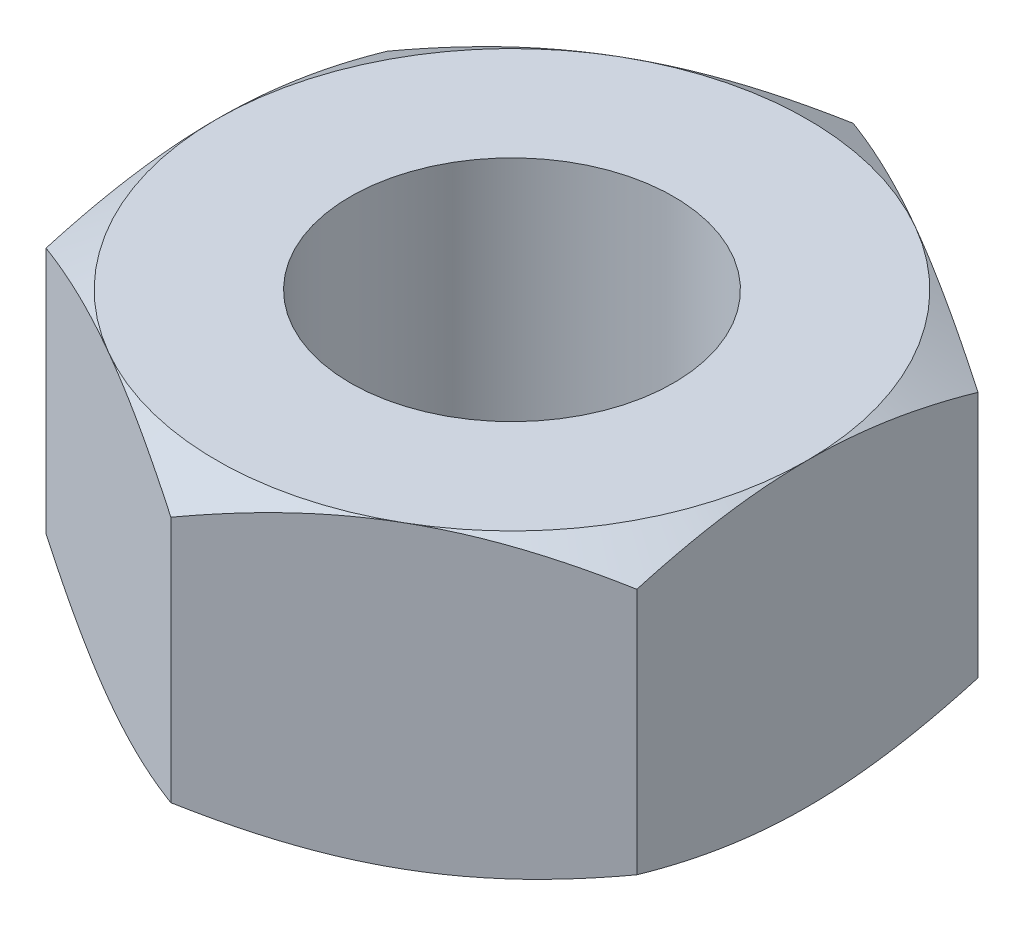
ISO-10303-21;
HEADER;
FILE_DESCRIPTION(('STEP AP214'),'2;1');
FILE_NAME('part.step','',(''),(''),'','','');
FILE_SCHEMA(('AUTOMOTIVE_DESIGN { 1 0 10303 214 1 1 1 1 }'));
ENDSEC;
DATA;
#1=APPLICATION_CONTEXT('core data for automotive mechanical design processes');
#2=APPLICATION_PROTOCOL_DEFINITION('international standard','automotive_design',2000,#1);
#3=PRODUCT_CONTEXT('',#1,'mechanical');
#4=PRODUCT('Part','Part','',(#3));
#5=PRODUCT_RELATED_PRODUCT_CATEGORY('part','',(#4));
#6=PRODUCT_DEFINITION_FORMATION('','',#4);
#7=PRODUCT_DEFINITION_CONTEXT('part definition',#1,'design');
#8=PRODUCT_DEFINITION('design','',#6,#7);
#9=PRODUCT_DEFINITION_SHAPE('','',#8);
#10=(LENGTH_UNIT() NAMED_UNIT(*) SI_UNIT(.MILLI.,.METRE.));
#11=(NAMED_UNIT(*) PLANE_ANGLE_UNIT() SI_UNIT($,.RADIAN.));
#12=(NAMED_UNIT(*) SI_UNIT($,.STERADIAN.) SOLID_ANGLE_UNIT());
#13=UNCERTAINTY_MEASURE_WITH_UNIT(LENGTH_MEASURE(1.E-05),#10,'distance_accuracy_value','');
#14=(GEOMETRIC_REPRESENTATION_CONTEXT(3) GLOBAL_UNCERTAINTY_ASSIGNED_CONTEXT((#13)) GLOBAL_UNIT_ASSIGNED_CONTEXT((#10,
#11,#12)) REPRESENTATION_CONTEXT('',''));
#15=CARTESIAN_POINT('',(0.,0.,0.));
#16=DIRECTION('',(0.,0.,1.));
#17=DIRECTION('',(1.,0.,0.));
#18=AXIS2_PLACEMENT_3D('',#15,#16,#17);
#19=CARTESIAN_POINT('',(12.8,6.5,-7.39008344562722));
#20=DIRECTION('',(-0.5,0.,0.866025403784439));
#21=DIRECTION('',(0.866025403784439,0.,0.5));
#22=AXIS2_PLACEMENT_3D('',#19,#20,#21);
#23=PLANE('',#22);
#24=DIRECTION('',(0.,-1.,0.));
#25=VECTOR('',#24,1.);
#26=CARTESIAN_POINT('',(12.8,6.5,-7.39008344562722));
#27=LINE('',#26,#25);
#28=CARTESIAN_POINT('',(12.8,5.35675011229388,-7.39008344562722));
#29=VERTEX_POINT('',#28);
#30=CARTESIAN_POINT('',(12.8,-5.35675011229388,-7.39008344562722));
#31=VERTEX_POINT('',#30);
#32=EDGE_CURVE('E244',#29,#31,#27,.T.);
#33=ORIENTED_EDGE('',*,*,#32,.T.);
#34=CARTESIAN_POINT('',(12.8002,-5.35668344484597,-7.38996797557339));
#35=CARTESIAN_POINT('',(12.5188607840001,-5.45045736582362,-7.55239924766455));
#36=CARTESIAN_POINT('',(12.2364241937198,-5.53997603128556,-7.71546408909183));
#37=CARTESIAN_POINT('',(11.6692862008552,-5.70932003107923,-8.04290136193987));
#38=CARTESIAN_POINT('',(11.3845840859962,-5.78914217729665,-8.20727420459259));
#39=CARTESIAN_POINT('',(10.8123648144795,-5.93802017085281,-8.53764515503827));
#40=CARTESIAN_POINT('',(10.5248426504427,-6.00705054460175,-8.70364615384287));
#41=CARTESIAN_POINT('',(9.94780038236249,-6.13286270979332,-9.03680166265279));
#42=CARTESIAN_POINT('',(9.65828039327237,-6.18964520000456,-9.20395610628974));
#43=CARTESIAN_POINT('',(9.08466110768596,-6.28854643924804,-9.53513535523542));
#44=CARTESIAN_POINT('',(8.80060439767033,-6.3309925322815,-9.69913557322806));
#45=CARTESIAN_POINT('',(8.23118936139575,-6.40216537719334,-10.0278874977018));
#46=CARTESIAN_POINT('',(7.94583101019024,-6.43089186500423,-10.1926392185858));
#47=CARTESIAN_POINT('',(7.37463493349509,-6.47390017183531,-10.5224194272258));
#48=CARTESIAN_POINT('',(7.08879818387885,-6.48819915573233,-10.687447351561));
#49=CARTESIAN_POINT('',(6.51686081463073,-6.50204494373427,-11.0176555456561));
#50=CARTESIAN_POINT('',(6.2307602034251,-6.50159220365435,-11.1828358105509));
#51=CARTESIAN_POINT('',(5.69589532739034,-6.48696486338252,-11.4916401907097));
#52=CARTESIAN_POINT('',(5.44709294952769,-6.47457444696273,-11.6352863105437));
#53=CARTESIAN_POINT('',(4.95006049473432,-6.43887089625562,-11.9222481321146));
#54=CARTESIAN_POINT('',(4.70183045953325,-6.41555698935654,-12.0655638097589));
#55=CARTESIAN_POINT('',(4.20607752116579,-6.35841295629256,-12.3517869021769));
#56=CARTESIAN_POINT('',(3.95855537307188,-6.32457414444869,-12.4946938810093));
#57=CARTESIAN_POINT('',(3.46467151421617,-6.24697400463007,-12.7798378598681));
#58=CARTESIAN_POINT('',(3.21830988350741,-6.20321200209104,-12.9220748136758));
#59=CARTESIAN_POINT('',(2.47046538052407,-6.05593495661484,-13.3538430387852));
#60=CARTESIAN_POINT('',(1.97114815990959,-5.93773476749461,-13.642123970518));
#61=CARTESIAN_POINT('',(0.979959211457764,-5.66946857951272,-14.2143871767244));
#62=CARTESIAN_POINT('',(0.488074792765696,-5.51946558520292,-14.4983767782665));
#63=CARTESIAN_POINT('',(-0.000199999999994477,-5.35668344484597,-14.7802823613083));
#64=B_SPLINE_CURVE_WITH_KNOTS('',3,(#34,#35,#36,#37,#38,#39,#40,#41,#42,#43,#44,#45,#46,#47,#48,
#49,#50,#51,#52,#53,#54,#55,#56,#57,#58,#59,#60,#61,#62,#63),.UNSPECIFIED.,.F.,.F.,(4,2,2,2,2,2,
2,2,2,2,2,2,2,2,4),(0.,1.01440467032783,2.02914196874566,3.04623948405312,4.06327895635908,
5.05521538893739,6.04717091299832,7.03794487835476,8.02868822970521,8.89115821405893,
9.7536892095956,10.6169339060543,11.4802373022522,13.2448088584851,15.0059167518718),.UNSPECIFIED.);
#65=CARTESIAN_POINT('',(6.4,-6.5,-11.0851251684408));
#66=VERTEX_POINT('',#65);
#67=EDGE_CURVE('E58',#31,#66,#64,.T.);
#68=ORIENTED_EDGE('',*,*,#67,.T.);
#69=CARTESIAN_POINT('',(0.,-5.35675011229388,-14.7801668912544));
#70=VERTEX_POINT('',#69);
#71=EDGE_CURVE('E189',#66,#70,#64,.T.);
#72=ORIENTED_EDGE('',*,*,#71,.T.);
#73=DIRECTION('',(0.,-1.,0.));
#74=VECTOR('',#73,1.);
#75=CARTESIAN_POINT('',(0.,6.5,-14.7801668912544));
#76=LINE('',#75,#74);
#77=CARTESIAN_POINT('',(0.,5.35675011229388,-14.7801668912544));
#78=VERTEX_POINT('',#77);
#79=EDGE_CURVE('E256',#78,#70,#76,.T.);
#80=ORIENTED_EDGE('',*,*,#79,.F.);
#81=CARTESIAN_POINT('',(12.8002,5.35668344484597,-7.38996797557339));
#82=CARTESIAN_POINT('',(12.5188607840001,5.45045736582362,-7.55239924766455));
#83=CARTESIAN_POINT('',(12.2364241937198,5.53997603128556,-7.71546408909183));
#84=CARTESIAN_POINT('',(11.6692862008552,5.70932003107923,-8.04290136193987));
#85=CARTESIAN_POINT('',(11.3845840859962,5.78914217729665,-8.20727420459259));
#86=CARTESIAN_POINT('',(10.8123648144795,5.93802017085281,-8.53764515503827));
#87=CARTESIAN_POINT('',(10.5248426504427,6.00705054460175,-8.70364615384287));
#88=CARTESIAN_POINT('',(9.94780038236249,6.13286270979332,-9.03680166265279));
#89=CARTESIAN_POINT('',(9.65828039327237,6.18964520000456,-9.20395610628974));
#90=CARTESIAN_POINT('',(9.08466110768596,6.28854643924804,-9.53513535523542));
#91=CARTESIAN_POINT('',(8.80060439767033,6.3309925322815,-9.69913557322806));
#92=CARTESIAN_POINT('',(8.23118936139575,6.40216537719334,-10.0278874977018));
#93=CARTESIAN_POINT('',(7.94583101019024,6.43089186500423,-10.1926392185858));
#94=CARTESIAN_POINT('',(7.37463493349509,6.47390017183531,-10.5224194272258));
#95=CARTESIAN_POINT('',(7.08879818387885,6.48819915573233,-10.687447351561));
#96=CARTESIAN_POINT('',(6.51686081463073,6.50204494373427,-11.0176555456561));
#97=CARTESIAN_POINT('',(6.2307602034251,6.50159220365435,-11.1828358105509));
#98=CARTESIAN_POINT('',(5.69589532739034,6.48696486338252,-11.4916401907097));
#99=CARTESIAN_POINT('',(5.44709294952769,6.47457444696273,-11.6352863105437));
#100=CARTESIAN_POINT('',(4.95006049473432,6.43887089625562,-11.9222481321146));
#101=CARTESIAN_POINT('',(4.70183045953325,6.41555698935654,-12.0655638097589));
#102=CARTESIAN_POINT('',(4.20607752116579,6.35841295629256,-12.3517869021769));
#103=CARTESIAN_POINT('',(3.95855537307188,6.32457414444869,-12.4946938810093));
#104=CARTESIAN_POINT('',(3.46467151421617,6.24697400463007,-12.7798378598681));
#105=CARTESIAN_POINT('',(3.21830988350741,6.20321200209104,-12.9220748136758));
#106=CARTESIAN_POINT('',(2.47046538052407,6.05593495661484,-13.3538430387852));
#107=CARTESIAN_POINT('',(1.97114815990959,5.93773476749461,-13.642123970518));
#108=CARTESIAN_POINT('',(0.979959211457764,5.66946857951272,-14.2143871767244));
#109=CARTESIAN_POINT('',(0.488074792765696,5.51946558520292,-14.4983767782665));
#110=CARTESIAN_POINT('',(-0.000199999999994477,5.35668344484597,-14.7802823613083));
#111=B_SPLINE_CURVE_WITH_KNOTS('',3,(#81,#82,#83,#84,#85,#86,#87,#88,#89,#90,#91,#92,#93,#94,
#95,#96,#97,#98,#99,#100,#101,#102,#103,#104,#105,#106,#107,#108,#109,#110),.UNSPECIFIED.,.F.,
.F.,(4,2,2,2,2,2,2,2,2,2,2,2,2,2,4),(0.,1.01440467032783,2.02914196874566,3.04623948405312,
4.06327895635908,5.05521538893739,6.04717091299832,7.03794487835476,8.02868822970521,
8.89115821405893,9.7536892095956,10.6169339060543,11.4802373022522,13.2448088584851,
15.0059167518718),.UNSPECIFIED.);
#112=CARTESIAN_POINT('',(6.4,6.5,-11.0851251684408));
#113=VERTEX_POINT('',#112);
#114=EDGE_CURVE('E238',#113,#78,#111,.T.);
#115=ORIENTED_EDGE('',*,*,#114,.F.);
#116=EDGE_CURVE('E243',#29,#113,#111,.T.);
#117=ORIENTED_EDGE('',*,*,#116,.F.);
#118=EDGE_LOOP('',(#33,#68,#72,#80,#115,#117));
#119=FACE_BOUND('',#118,.T.);
#120=ADVANCED_FACE('F36',(#119),#23,.F.);
#121=CARTESIAN_POINT('',(0.,6.5,-14.7801668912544));
#122=DIRECTION('',(0.5,0.,0.866025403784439));
#123=DIRECTION('',(0.866025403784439,0.,-0.5));
#124=AXIS2_PLACEMENT_3D('',#121,#122,#123);
#125=PLANE('',#124);
#126=ORIENTED_EDGE('',*,*,#79,.T.);
#127=CARTESIAN_POINT('',(0.000200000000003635,-5.35668344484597,-14.7802823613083));
#128=CARTESIAN_POINT('',(-0.281139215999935,-5.45045736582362,-14.6178510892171));
#129=CARTESIAN_POINT('',(-0.563575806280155,-5.53997603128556,-14.4547862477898));
#130=CARTESIAN_POINT('',(-1.13071379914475,-5.70932003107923,-14.1273489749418));
#131=CARTESIAN_POINT('',(-1.41541591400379,-5.78914217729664,-13.9629761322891));
#132=CARTESIAN_POINT('',(-1.98763518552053,-5.93802017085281,-13.6326051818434));
#133=CARTESIAN_POINT('',(-2.27515734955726,-6.00705054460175,-13.4666041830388));
#134=CARTESIAN_POINT('',(-2.85219961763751,-6.13286270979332,-13.1334486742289));
#135=CARTESIAN_POINT('',(-3.14171960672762,-6.18964520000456,-12.9662942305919));
#136=CARTESIAN_POINT('',(-3.71533889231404,-6.28854643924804,-12.6351149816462));
#137=CARTESIAN_POINT('',(-3.99939560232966,-6.3309925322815,-12.4711147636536));
#138=CARTESIAN_POINT('',(-4.56881063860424,-6.40216537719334,-12.1423628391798));
#139=CARTESIAN_POINT('',(-4.85416898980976,-6.43089186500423,-11.9776111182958));
#140=CARTESIAN_POINT('',(-5.4253650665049,-6.47390017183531,-11.6478309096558));
#141=CARTESIAN_POINT('',(-5.71120181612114,-6.48819915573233,-11.4828029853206));
#142=CARTESIAN_POINT('',(-6.28313918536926,-6.50204494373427,-11.1525947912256));
#143=CARTESIAN_POINT('',(-6.5692397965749,-6.50159220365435,-10.9874145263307));
#144=CARTESIAN_POINT('',(-7.10410467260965,-6.48696486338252,-10.678610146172));
#145=CARTESIAN_POINT('',(-7.3529070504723,-6.47457444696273,-10.5349640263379));
#146=CARTESIAN_POINT('',(-7.84993950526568,-6.43887089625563,-10.248002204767));
#147=CARTESIAN_POINT('',(-8.09816954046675,-6.41555698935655,-10.1046865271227));
#148=CARTESIAN_POINT('',(-8.59392247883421,-6.35841295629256,-9.81846343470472));
#149=CARTESIAN_POINT('',(-8.84144462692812,-6.32457414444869,-9.67555645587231));
#150=CARTESIAN_POINT('',(-9.33532848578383,-6.24697400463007,-9.39041247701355));
#151=CARTESIAN_POINT('',(-9.5816901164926,-6.20321200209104,-9.24817552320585));
#152=CARTESIAN_POINT('',(-10.3295346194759,-6.05593495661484,-8.81640729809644));
#153=CARTESIAN_POINT('',(-10.8288518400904,-5.93773476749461,-8.52812636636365));
#154=CARTESIAN_POINT('',(-11.8200407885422,-5.66946857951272,-7.95586316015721));
#155=CARTESIAN_POINT('',(-12.3119252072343,-5.51946558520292,-7.67187355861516));
#156=CARTESIAN_POINT('',(-12.8002,-5.35668344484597,-7.38996797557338));
#157=B_SPLINE_CURVE_WITH_KNOTS('',3,(#127,#128,#129,#130,#131,#132,#133,#134,#135,#136,#137,
#138,#139,#140,#141,#142,#143,#144,#145,#146,#147,#148,#149,#150,#151,#152,#153,#154,#155,#156),
.UNSPECIFIED.,.F.,.F.,(4,2,2,2,2,2,2,2,2,2,2,2,2,2,4),(0.,1.01440467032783,2.02914196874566,
3.04623948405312,4.06327895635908,5.05521538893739,6.04717091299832,7.03794487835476,
8.02868822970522,8.89115821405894,9.7536892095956,10.6169339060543,11.4802373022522,
13.2448088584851,15.0059167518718),.UNSPECIFIED.);
#158=CARTESIAN_POINT('',(-6.4,-6.5,-11.0851251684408));
#159=VERTEX_POINT('',#158);
#160=EDGE_CURVE('E337',#70,#159,#157,.T.);
#161=ORIENTED_EDGE('',*,*,#160,.T.);
#162=CARTESIAN_POINT('',(-12.8,-5.35675011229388,-7.39008344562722));
#163=VERTEX_POINT('',#162);
#164=EDGE_CURVE('E205',#159,#163,#157,.T.);
#165=ORIENTED_EDGE('',*,*,#164,.T.);
#166=DIRECTION('',(0.,-1.,0.));
#167=VECTOR('',#166,1.);
#168=CARTESIAN_POINT('',(-12.8,6.5,-7.39008344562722));
#169=LINE('',#168,#167);
#170=CARTESIAN_POINT('',(-12.8,5.35675011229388,-7.39008344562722));
#171=VERTEX_POINT('',#170);
#172=EDGE_CURVE('E253',#171,#163,#169,.T.);
#173=ORIENTED_EDGE('',*,*,#172,.F.);
#174=CARTESIAN_POINT('',(0.000200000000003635,5.35668344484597,-14.7802823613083));
#175=CARTESIAN_POINT('',(-0.281139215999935,5.45045736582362,-14.6178510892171));
#176=CARTESIAN_POINT('',(-0.563575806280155,5.53997603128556,-14.4547862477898));
#177=CARTESIAN_POINT('',(-1.13071379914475,5.70932003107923,-14.1273489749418));
#178=CARTESIAN_POINT('',(-1.41541591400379,5.78914217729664,-13.9629761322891));
#179=CARTESIAN_POINT('',(-1.98763518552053,5.93802017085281,-13.6326051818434));
#180=CARTESIAN_POINT('',(-2.27515734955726,6.00705054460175,-13.4666041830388));
#181=CARTESIAN_POINT('',(-2.85219961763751,6.13286270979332,-13.1334486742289));
#182=CARTESIAN_POINT('',(-3.14171960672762,6.18964520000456,-12.9662942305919));
#183=CARTESIAN_POINT('',(-3.71533889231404,6.28854643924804,-12.6351149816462));
#184=CARTESIAN_POINT('',(-3.99939560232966,6.3309925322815,-12.4711147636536));
#185=CARTESIAN_POINT('',(-4.56881063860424,6.40216537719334,-12.1423628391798));
#186=CARTESIAN_POINT('',(-4.85416898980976,6.43089186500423,-11.9776111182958));
#187=CARTESIAN_POINT('',(-5.4253650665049,6.47390017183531,-11.6478309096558));
#188=CARTESIAN_POINT('',(-5.71120181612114,6.48819915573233,-11.4828029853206));
#189=CARTESIAN_POINT('',(-6.28313918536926,6.50204494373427,-11.1525947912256));
#190=CARTESIAN_POINT('',(-6.5692397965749,6.50159220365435,-10.9874145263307));
#191=CARTESIAN_POINT('',(-7.10410467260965,6.48696486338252,-10.678610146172));
#192=CARTESIAN_POINT('',(-7.3529070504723,6.47457444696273,-10.5349640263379));
#193=CARTESIAN_POINT('',(-7.84993950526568,6.43887089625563,-10.248002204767));
#194=CARTESIAN_POINT('',(-8.09816954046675,6.41555698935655,-10.1046865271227));
#195=CARTESIAN_POINT('',(-8.59392247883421,6.35841295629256,-9.81846343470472));
#196=CARTESIAN_POINT('',(-8.84144462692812,6.32457414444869,-9.67555645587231));
#197=CARTESIAN_POINT('',(-9.33532848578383,6.24697400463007,-9.39041247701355));
#198=CARTESIAN_POINT('',(-9.5816901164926,6.20321200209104,-9.24817552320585));
#199=CARTESIAN_POINT('',(-10.3295346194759,6.05593495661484,-8.81640729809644));
#200=CARTESIAN_POINT('',(-10.8288518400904,5.93773476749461,-8.52812636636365));
#201=CARTESIAN_POINT('',(-11.8200407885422,5.66946857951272,-7.95586316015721));
#202=CARTESIAN_POINT('',(-12.3119252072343,5.51946558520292,-7.67187355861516));
#203=CARTESIAN_POINT('',(-12.8002,5.35668344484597,-7.38996797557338));
#204=B_SPLINE_CURVE_WITH_KNOTS('',3,(#174,#175,#176,#177,#178,#179,#180,#181,#182,#183,#184,
#185,#186,#187,#188,#189,#190,#191,#192,#193,#194,#195,#196,#197,#198,#199,#200,#201,#202,#203),
.UNSPECIFIED.,.F.,.F.,(4,2,2,2,2,2,2,2,2,2,2,2,2,2,4),(0.,1.01440467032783,2.02914196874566,
3.04623948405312,4.06327895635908,5.05521538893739,6.04717091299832,7.03794487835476,
8.02868822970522,8.89115821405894,9.7536892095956,10.6169339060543,11.4802373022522,
13.2448088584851,15.0059167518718),.UNSPECIFIED.);
#205=CARTESIAN_POINT('',(-6.4,6.5,-11.0851251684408));
#206=VERTEX_POINT('',#205);
#207=EDGE_CURVE('E232',#206,#171,#204,.T.);
#208=ORIENTED_EDGE('',*,*,#207,.F.);
#209=EDGE_CURVE('E237',#78,#206,#204,.T.);
#210=ORIENTED_EDGE('',*,*,#209,.F.);
#211=EDGE_LOOP('',(#126,#161,#165,#173,#208,#210));
#212=FACE_BOUND('',#211,.T.);
#213=ADVANCED_FACE('F213',(#212),#125,.F.);
#214=CARTESIAN_POINT('',(-12.8,6.5,-7.39008344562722));
#215=DIRECTION('',(1.,0.,0.));
#216=DIRECTION('',(0.,0.,-1.));
#217=AXIS2_PLACEMENT_3D('',#214,#215,#216);
#218=PLANE('',#217);
#219=ORIENTED_EDGE('',*,*,#172,.T.);
#220=CARTESIAN_POINT('',(-12.8,-0.112766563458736,-20.1395973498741));
#221=CARTESIAN_POINT('',(-12.8,-0.24958762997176,-19.8587977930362));
#222=CARTESIAN_POINT('',(-12.8,-0.385747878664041,-19.5776763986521));
#223=CARTESIAN_POINT('',(-12.8,-0.656597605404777,-19.0147228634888));
#224=CARTESIAN_POINT('',(-12.8,-0.791287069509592,-18.7328907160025));
#225=CARTESIAN_POINT('',(-12.8,-1.19295928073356,-17.8861563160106));
#226=CARTESIAN_POINT('',(-12.8,-1.45750736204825,-17.3200948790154));
#227=CARTESIAN_POINT('',(-12.8,-1.97992760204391,-16.1813348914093));
#228=CARTESIAN_POINT('',(-12.8,-2.2377580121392,-15.6086171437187));
#229=CARTESIAN_POINT('',(-12.8,-2.74324852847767,-14.4587262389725));
#230=CARTESIAN_POINT('',(-12.8,-2.99090909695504,-13.8815532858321));
#231=CARTESIAN_POINT('',(-12.8,-3.48151573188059,-12.7022727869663));
#232=CARTESIAN_POINT('',(-12.8,-3.72402093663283,-12.0999809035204));
#233=CARTESIAN_POINT('',(-12.8,-4.19136839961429,-10.8884544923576));
#234=CARTESIAN_POINT('',(-12.8,-4.41620871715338,-10.2792192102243));
#235=CARTESIAN_POINT('',(-12.8,-4.84253190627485,-9.05390504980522));
#236=CARTESIAN_POINT('',(-12.8,-5.0440596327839,-8.43784189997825));
#237=CARTESIAN_POINT('',(-12.8,-5.41749625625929,-7.19682667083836));
#238=CARTESIAN_POINT('',(-12.8,-5.58941417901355,-6.57187736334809));
#239=CARTESIAN_POINT('',(-12.8,-5.81854437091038,-5.6293624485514));
#240=CARTESIAN_POINT('',(-12.8,-5.889969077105,-5.31523290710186));
#241=CARTESIAN_POINT('',(-12.8,-6.02240893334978,-4.6847756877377));
#242=CARTESIAN_POINT('',(-12.8,-6.0834242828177,-4.36844805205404));
#243=CARTESIAN_POINT('',(-12.8,-6.19398682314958,-3.73379305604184));
#244=CARTESIAN_POINT('',(-12.8,-6.24353430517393,-3.4154657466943));
#245=CARTESIAN_POINT('',(-12.8,-6.33018484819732,-2.77712324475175));
#246=CARTESIAN_POINT('',(-12.8,-6.36728841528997,-2.45710812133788));
#247=CARTESIAN_POINT('',(-12.8,-6.42783201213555,-1.82014231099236));
#248=CARTESIAN_POINT('',(-12.8,-6.45144985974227,-1.5032086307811));
#249=CARTESIAN_POINT('',(-12.8,-6.48524933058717,-0.868626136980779));
#250=CARTESIAN_POINT('',(-12.8,-6.49543118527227,-0.550977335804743));
#251=CARTESIAN_POINT('',(-12.8,-6.50211494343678,0.084469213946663));
#252=CARTESIAN_POINT('',(-12.8,-6.49861676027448,0.402266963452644));
#253=CARTESIAN_POINT('',(-12.8,-6.4780290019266,1.03742517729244));
#254=CARTESIAN_POINT('',(-12.8,-6.46093881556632,1.35478562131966));
#255=CARTESIAN_POINT('',(-12.8,-6.40455726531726,2.10878486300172));
#256=CARTESIAN_POINT('',(-12.8,-6.35930222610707,2.54498792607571));
#257=CARTESIAN_POINT('',(-12.8,-6.2455184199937,3.4143242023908));
#258=CARTESIAN_POINT('',(-12.8,-6.17698673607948,3.84745702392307));
#259=CARTESIAN_POINT('',(-12.8,-5.94009713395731,5.14164843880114));
#260=CARTESIAN_POINT('',(-12.8,-5.7404811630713,5.99707070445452));
#261=CARTESIAN_POINT('',(-12.8,-5.39212433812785,7.27682288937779));
#262=CARTESIAN_POINT('',(-12.8,-5.26612441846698,7.7077262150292));
#263=CARTESIAN_POINT('',(-12.8,-5.00049439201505,8.5653527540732));
#264=CARTESIAN_POINT('',(-12.8,-4.86086418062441,8.99207593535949));
#265=CARTESIAN_POINT('',(-12.8,-4.5702571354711,9.84146915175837));
#266=CARTESIAN_POINT('',(-12.8,-4.41928352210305,10.2641402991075));
#267=CARTESIAN_POINT('',(-12.8,-4.10782698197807,11.1059448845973));
#268=CARTESIAN_POINT('',(-12.8,-3.94734427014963,11.5250784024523));
#269=CARTESIAN_POINT('',(-12.8,-3.64360403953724,12.2962531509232));
#270=CARTESIAN_POINT('',(-12.8,-3.5014721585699,12.6487396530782));
#271=CARTESIAN_POINT('',(-12.8,-3.21227498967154,13.3516857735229));
#272=CARTESIAN_POINT('',(-12.8,-3.06520962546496,13.7021453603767));
#273=CARTESIAN_POINT('',(-12.8,-2.61761638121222,14.7508591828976));
#274=CARTESIAN_POINT('',(-12.8,-2.31071310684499,15.4463938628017));
#275=CARTESIAN_POINT('',(-12.8,-1.68397040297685,16.831890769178));
#276=CARTESIAN_POINT('',(-12.8,-1.36412609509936,17.5218507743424));
#277=CARTESIAN_POINT('',(-12.8,-0.71456644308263,18.8970639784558));
#278=CARTESIAN_POINT('',(-12.8,-0.384851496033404,19.5823173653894));
#279=CARTESIAN_POINT('',(-12.8,0.28283328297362,20.9501355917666));
#280=CARTESIAN_POINT('',(-12.8,0.620815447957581,21.6326943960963));
#281=CARTESIAN_POINT('',(-12.8,1.30293068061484,22.9947337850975));
#282=CARTESIAN_POINT('',(-12.8,1.64706379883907,23.6742143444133));
#283=CARTESIAN_POINT('',(-12.8,2.34020060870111,25.0304987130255));
#284=CARTESIAN_POINT('',(-12.8,2.68920323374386,25.7073030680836));
#285=CARTESIAN_POINT('',(-12.8,3.39124082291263,27.0588122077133));
#286=CARTESIAN_POINT('',(-12.8,3.74427577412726,27.733516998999));
#287=CARTESIAN_POINT('',(-12.8,4.73361584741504,29.6130525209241));
#288=CARTESIAN_POINT('',(-12.8,5.3735629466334,30.8159658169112));
#289=CARTESIAN_POINT('',(-12.8,6.66116043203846,33.2177476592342));
#290=CARTESIAN_POINT('',(-12.8,7.30881128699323,34.4166159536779));
#291=CARTESIAN_POINT('',(-12.8,8.60768962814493,36.8072307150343));
#292=CARTESIAN_POINT('',(-12.8,9.25889795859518,37.9989875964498));
#293=CARTESIAN_POINT('',(-12.8,10.2389723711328,39.7847702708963));
#294=CARTESIAN_POINT('',(-12.8,10.5661947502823,40.3796993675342));
#295=CARTESIAN_POINT('',(-12.8,11.2216137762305,41.5690197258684));
#296=CARTESIAN_POINT('',(-12.8,11.5498104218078,42.1634109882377));
#297=CARTESIAN_POINT('',(-12.8,11.8784339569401,42.7575662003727));
#298=B_SPLINE_CURVE_WITH_KNOTS('',3,(#220,#221,#222,#223,#224,#225,#226,#227,#228,#229,#230,
#231,#232,#233,#234,#235,#236,#237,#238,#239,#240,#241,#242,#243,#244,#245,#246,#247,#248,#249,
#250,#251,#252,#253,#254,#255,#256,#257,#258,#259,#260,#261,#262,#263,#264,#265,#266,#267,#268,
#269,#270,#271,#272,#273,#274,#275,#276,#277,#278,#279,#280,#281,#282,#283,#284,#285,#286,#287,
#288,#289,#290,#291,#292,#293,#294,#295,#296,#297),.UNSPECIFIED.,.F.,.F.,(4,2,2,2,2,2,2,2,2,2,2,
2,2,2,2,2,2,2,2,2,2,2,2,2,2,2,2,2,2,2,2,2,2,2,2,2,2,2,4),(0.,0.937076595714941,1.87416206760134,
3.74859601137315,5.6327532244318,7.51682470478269,9.46445250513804,11.4122939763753,
13.3563230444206,15.2997584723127,16.2660557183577,17.2323344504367,18.1985886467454,
19.1648035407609,20.1179652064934,21.0711104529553,22.0242617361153,22.977455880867,
24.2923522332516,25.6074134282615,28.2388224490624,29.5855438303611,30.9322755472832,
32.2786263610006,33.6249467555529,34.7650964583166,35.9052637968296,38.1857747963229,
40.4671536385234,42.7484408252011,45.0333683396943,47.3183146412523,49.6027680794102,
51.8872142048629,55.9748098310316,60.062655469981,64.1368555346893,66.1737976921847,
68.210737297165),.UNSPECIFIED.);
#299=CARTESIAN_POINT('',(-12.8,-6.5,0.));
#300=VERTEX_POINT('',#299);
#301=EDGE_CURVE('E204',#163,#300,#298,.T.);
#302=ORIENTED_EDGE('',*,*,#301,.T.);
#303=CARTESIAN_POINT('',(-12.8,-5.35675011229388,7.39008344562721));
#304=VERTEX_POINT('',#303);
#305=EDGE_CURVE('E198',#300,#304,#298,.T.);
#306=ORIENTED_EDGE('',*,*,#305,.T.);
#307=DIRECTION('',(0.,-1.,0.));
#308=VECTOR('',#307,1.);
#309=CARTESIAN_POINT('',(-12.8,6.5,7.39008344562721));
#310=LINE('',#309,#308);
#311=CARTESIAN_POINT('',(-12.8,5.35675011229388,7.39008344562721));
#312=VERTEX_POINT('',#311);
#313=EDGE_CURVE('E250',#312,#304,#310,.T.);
#314=ORIENTED_EDGE('',*,*,#313,.F.);
#315=CARTESIAN_POINT('',(-12.8,0.112766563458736,-20.1395973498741));
#316=CARTESIAN_POINT('',(-12.8,0.24958762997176,-19.8587977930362));
#317=CARTESIAN_POINT('',(-12.8,0.385747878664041,-19.5776763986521));
#318=CARTESIAN_POINT('',(-12.8,0.656597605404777,-19.0147228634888));
#319=CARTESIAN_POINT('',(-12.8,0.791287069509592,-18.7328907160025));
#320=CARTESIAN_POINT('',(-12.8,1.19295928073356,-17.8861563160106));
#321=CARTESIAN_POINT('',(-12.8,1.45750736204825,-17.3200948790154));
#322=CARTESIAN_POINT('',(-12.8,1.97992760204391,-16.1813348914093));
#323=CARTESIAN_POINT('',(-12.8,2.2377580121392,-15.6086171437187));
#324=CARTESIAN_POINT('',(-12.8,2.74324852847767,-14.4587262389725));
#325=CARTESIAN_POINT('',(-12.8,2.99090909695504,-13.8815532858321));
#326=CARTESIAN_POINT('',(-12.8,3.48151573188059,-12.7022727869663));
#327=CARTESIAN_POINT('',(-12.8,3.72402093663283,-12.0999809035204));
#328=CARTESIAN_POINT('',(-12.8,4.19136839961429,-10.8884544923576));
#329=CARTESIAN_POINT('',(-12.8,4.41620871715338,-10.2792192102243));
#330=CARTESIAN_POINT('',(-12.8,4.84253190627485,-9.05390504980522));
#331=CARTESIAN_POINT('',(-12.8,5.0440596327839,-8.43784189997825));
#332=CARTESIAN_POINT('',(-12.8,5.41749625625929,-7.19682667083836));
#333=CARTESIAN_POINT('',(-12.8,5.58941417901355,-6.57187736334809));
#334=CARTESIAN_POINT('',(-12.8,5.81854437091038,-5.6293624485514));
#335=CARTESIAN_POINT('',(-12.8,5.889969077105,-5.31523290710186));
#336=CARTESIAN_POINT('',(-12.8,6.02240893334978,-4.6847756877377));
#337=CARTESIAN_POINT('',(-12.8,6.0834242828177,-4.36844805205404));
#338=CARTESIAN_POINT('',(-12.8,6.19398682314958,-3.73379305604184));
#339=CARTESIAN_POINT('',(-12.8,6.24353430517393,-3.4154657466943));
#340=CARTESIAN_POINT('',(-12.8,6.33018484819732,-2.77712324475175));
#341=CARTESIAN_POINT('',(-12.8,6.36728841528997,-2.45710812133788));
#342=CARTESIAN_POINT('',(-12.8,6.42783201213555,-1.82014231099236));
#343=CARTESIAN_POINT('',(-12.8,6.45144985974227,-1.5032086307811));
#344=CARTESIAN_POINT('',(-12.8,6.48524933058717,-0.868626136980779));
#345=CARTESIAN_POINT('',(-12.8,6.49543118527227,-0.550977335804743));
#346=CARTESIAN_POINT('',(-12.8,6.50211494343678,0.084469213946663));
#347=CARTESIAN_POINT('',(-12.8,6.49861676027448,0.402266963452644));
#348=CARTESIAN_POINT('',(-12.8,6.4780290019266,1.03742517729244));
#349=CARTESIAN_POINT('',(-12.8,6.46093881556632,1.35478562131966));
#350=CARTESIAN_POINT('',(-12.8,6.40455726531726,2.10878486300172));
#351=CARTESIAN_POINT('',(-12.8,6.35930222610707,2.54498792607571));
#352=CARTESIAN_POINT('',(-12.8,6.2455184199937,3.4143242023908));
#353=CARTESIAN_POINT('',(-12.8,6.17698673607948,3.84745702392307));
#354=CARTESIAN_POINT('',(-12.8,5.94009713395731,5.14164843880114));
#355=CARTESIAN_POINT('',(-12.8,5.7404811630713,5.99707070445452));
#356=CARTESIAN_POINT('',(-12.8,5.39212433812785,7.27682288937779));
#357=CARTESIAN_POINT('',(-12.8,5.26612441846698,7.7077262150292));
#358=CARTESIAN_POINT('',(-12.8,5.00049439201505,8.5653527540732));
#359=CARTESIAN_POINT('',(-12.8,4.86086418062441,8.99207593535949));
#360=CARTESIAN_POINT('',(-12.8,4.5702571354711,9.84146915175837));
#361=CARTESIAN_POINT('',(-12.8,4.41928352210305,10.2641402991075));
#362=CARTESIAN_POINT('',(-12.8,4.10782698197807,11.1059448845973));
#363=CARTESIAN_POINT('',(-12.8,3.94734427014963,11.5250784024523));
#364=CARTESIAN_POINT('',(-12.8,3.64360403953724,12.2962531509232));
#365=CARTESIAN_POINT('',(-12.8,3.5014721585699,12.6487396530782));
#366=CARTESIAN_POINT('',(-12.8,3.21227498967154,13.3516857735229));
#367=CARTESIAN_POINT('',(-12.8,3.06520962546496,13.7021453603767));
#368=CARTESIAN_POINT('',(-12.8,2.61761638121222,14.7508591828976));
#369=CARTESIAN_POINT('',(-12.8,2.31071310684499,15.4463938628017));
#370=CARTESIAN_POINT('',(-12.8,1.68397040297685,16.831890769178));
#371=CARTESIAN_POINT('',(-12.8,1.36412609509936,17.5218507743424));
#372=CARTESIAN_POINT('',(-12.8,0.71456644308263,18.8970639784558));
#373=CARTESIAN_POINT('',(-12.8,0.384851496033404,19.5823173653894));
#374=CARTESIAN_POINT('',(-12.8,-0.28283328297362,20.9501355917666));
#375=CARTESIAN_POINT('',(-12.8,-0.620815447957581,21.6326943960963));
#376=CARTESIAN_POINT('',(-12.8,-1.30293068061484,22.9947337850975));
#377=CARTESIAN_POINT('',(-12.8,-1.64706379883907,23.6742143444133));
#378=CARTESIAN_POINT('',(-12.8,-2.34020060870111,25.0304987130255));
#379=CARTESIAN_POINT('',(-12.8,-2.68920323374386,25.7073030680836));
#380=CARTESIAN_POINT('',(-12.8,-3.39124082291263,27.0588122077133));
#381=CARTESIAN_POINT('',(-12.8,-3.74427577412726,27.733516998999));
#382=CARTESIAN_POINT('',(-12.8,-4.73361584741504,29.6130525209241));
#383=CARTESIAN_POINT('',(-12.8,-5.3735629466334,30.8159658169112));
#384=CARTESIAN_POINT('',(-12.8,-6.66116043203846,33.2177476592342));
#385=CARTESIAN_POINT('',(-12.8,-7.30881128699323,34.4166159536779));
#386=CARTESIAN_POINT('',(-12.8,-8.60768962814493,36.8072307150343));
#387=CARTESIAN_POINT('',(-12.8,-9.25889795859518,37.9989875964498));
#388=CARTESIAN_POINT('',(-12.8,-10.2389723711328,39.7847702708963));
#389=CARTESIAN_POINT('',(-12.8,-10.5661947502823,40.3796993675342));
#390=CARTESIAN_POINT('',(-12.8,-11.2216137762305,41.5690197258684));
#391=CARTESIAN_POINT('',(-12.8,-11.5498104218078,42.1634109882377));
#392=CARTESIAN_POINT('',(-12.8,-11.8784339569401,42.7575662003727));
#393=B_SPLINE_CURVE_WITH_KNOTS('',3,(#315,#316,#317,#318,#319,#320,#321,#322,#323,#324,#325,
#326,#327,#328,#329,#330,#331,#332,#333,#334,#335,#336,#337,#338,#339,#340,#341,#342,#343,#344,
#345,#346,#347,#348,#349,#350,#351,#352,#353,#354,#355,#356,#357,#358,#359,#360,#361,#362,#363,
#364,#365,#366,#367,#368,#369,#370,#371,#372,#373,#374,#375,#376,#377,#378,#379,#380,#381,#382,
#383,#384,#385,#386,#387,#388,#389,#390,#391,#392),.UNSPECIFIED.,.F.,.F.,(4,2,2,2,2,2,2,2,2,2,2,
2,2,2,2,2,2,2,2,2,2,2,2,2,2,2,2,2,2,2,2,2,2,2,2,2,2,2,4),(0.,0.937076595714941,1.87416206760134,
3.74859601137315,5.6327532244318,7.51682470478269,9.46445250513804,11.4122939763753,
13.3563230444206,15.2997584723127,16.2660557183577,17.2323344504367,18.1985886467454,
19.1648035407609,20.1179652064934,21.0711104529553,22.0242617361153,22.977455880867,
24.2923522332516,25.6074134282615,28.2388224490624,29.5855438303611,30.9322755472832,
32.2786263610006,33.6249467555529,34.7650964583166,35.9052637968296,38.1857747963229,
40.4671536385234,42.7484408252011,45.0333683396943,47.3183146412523,49.6027680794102,
51.8872142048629,55.9748098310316,60.062655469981,64.1368555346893,66.1737976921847,
68.210737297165),.UNSPECIFIED.);
#394=CARTESIAN_POINT('',(-12.8,6.5,0.));
#395=VERTEX_POINT('',#394);
#396=EDGE_CURVE('E219',#395,#312,#393,.T.);
#397=ORIENTED_EDGE('',*,*,#396,.F.);
#398=EDGE_CURVE('E225',#171,#395,#393,.T.);
#399=ORIENTED_EDGE('',*,*,#398,.F.);
#400=EDGE_LOOP('',(#219,#302,#306,#314,#397,#399));
#401=FACE_BOUND('',#400,.T.);
#402=ADVANCED_FACE('F209',(#401),#218,.F.);
#403=CARTESIAN_POINT('',(-12.8,6.5,7.39008344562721));
#404=DIRECTION('',(0.5,0.,-0.866025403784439));
#405=DIRECTION('',(-0.866025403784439,0.,-0.5));
#406=AXIS2_PLACEMENT_3D('',#403,#404,#405);
#407=PLANE('',#406);
#408=ORIENTED_EDGE('',*,*,#313,.T.);
#409=CARTESIAN_POINT('',(-12.8002,-5.35668344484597,7.38996797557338));
#410=CARTESIAN_POINT('',(-12.5188607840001,-5.45045736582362,7.55239924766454));
#411=CARTESIAN_POINT('',(-12.2364241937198,-5.53997603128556,7.71546408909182));
#412=CARTESIAN_POINT('',(-11.6692862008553,-5.70932003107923,8.04290136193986));
#413=CARTESIAN_POINT('',(-11.3845840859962,-5.78914217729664,8.20727420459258));
#414=CARTESIAN_POINT('',(-10.8123648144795,-5.93802017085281,8.53764515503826));
#415=CARTESIAN_POINT('',(-10.5248426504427,-6.00705054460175,8.70364615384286));
#416=CARTESIAN_POINT('',(-9.9478003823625,-6.13286270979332,9.03680166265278));
#417=CARTESIAN_POINT('',(-9.65828039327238,-6.18964520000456,9.20395610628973));
#418=CARTESIAN_POINT('',(-9.08466110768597,-6.28854643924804,9.53513535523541));
#419=CARTESIAN_POINT('',(-8.80060439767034,-6.3309925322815,9.69913557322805));
#420=CARTESIAN_POINT('',(-8.23118936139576,-6.40216537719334,10.0278874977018));
#421=CARTESIAN_POINT('',(-7.94583101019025,-6.43089186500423,10.1926392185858));
#422=CARTESIAN_POINT('',(-7.3746349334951,-6.47390017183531,10.5224194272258));
#423=CARTESIAN_POINT('',(-7.08879818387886,-6.48819915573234,10.687447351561));
#424=CARTESIAN_POINT('',(-6.51686081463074,-6.50204494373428,11.017655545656));
#425=CARTESIAN_POINT('',(-6.23076020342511,-6.50159220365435,11.1828358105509));
#426=CARTESIAN_POINT('',(-5.69589532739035,-6.48696486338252,11.4916401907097));
#427=CARTESIAN_POINT('',(-5.4470929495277,-6.47457444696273,11.6352863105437));
#428=CARTESIAN_POINT('',(-4.95006049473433,-6.43887089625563,11.9222481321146));
#429=CARTESIAN_POINT('',(-4.70183045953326,-6.41555698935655,12.0655638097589));
#430=CARTESIAN_POINT('',(-4.2060775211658,-6.35841295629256,12.3517869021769));
#431=CARTESIAN_POINT('',(-3.95855537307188,-6.32457414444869,12.4946938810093));
#432=CARTESIAN_POINT('',(-3.46467151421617,-6.24697400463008,12.7798378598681));
#433=CARTESIAN_POINT('',(-3.21830988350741,-6.20321200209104,12.9220748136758));
#434=CARTESIAN_POINT('',(-2.47046538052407,-6.05593495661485,13.3538430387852));
#435=CARTESIAN_POINT('',(-1.97114815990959,-5.93773476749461,13.642123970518));
#436=CARTESIAN_POINT('',(-0.979959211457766,-5.66946857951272,14.2143871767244));
#437=CARTESIAN_POINT('',(-0.488074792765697,-5.51946558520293,14.4983767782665));
#438=CARTESIAN_POINT('',(0.000199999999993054,-5.35668344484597,14.7802823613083));
#439=B_SPLINE_CURVE_WITH_KNOTS('',3,(#409,#410,#411,#412,#413,#414,#415,#416,#417,#418,#419,
#420,#421,#422,#423,#424,#425,#426,#427,#428,#429,#430,#431,#432,#433,#434,#435,#436,#437,#438),
.UNSPECIFIED.,.F.,.F.,(4,2,2,2,2,2,2,2,2,2,2,2,2,2,4),(0.,1.01440467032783,2.02914196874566,
3.04623948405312,4.06327895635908,5.05521538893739,6.04717091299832,7.03794487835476,
8.02868822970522,8.89115821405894,9.7536892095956,10.6169339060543,11.4802373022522,
13.2448088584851,15.0059167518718),.UNSPECIFIED.);
#440=CARTESIAN_POINT('',(-6.4,-6.5,11.0851251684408));
#441=VERTEX_POINT('',#440);
#442=EDGE_CURVE('E158',#304,#441,#439,.T.);
#443=ORIENTED_EDGE('',*,*,#442,.T.);
#444=CARTESIAN_POINT('',(0.,-5.35675011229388,14.7801668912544));
#445=VERTEX_POINT('',#444);
#446=EDGE_CURVE('E143',#441,#445,#439,.T.);
#447=ORIENTED_EDGE('',*,*,#446,.T.);
#448=DIRECTION('',(0.,-1.,0.));
#449=VECTOR('',#448,1.);
#450=CARTESIAN_POINT('',(0.,6.5,14.7801668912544));
#451=LINE('',#450,#449);
#452=CARTESIAN_POINT('',(0.,5.35675011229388,14.7801668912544));
#453=VERTEX_POINT('',#452);
#454=EDGE_CURVE('E157',#453,#445,#451,.T.);
#455=ORIENTED_EDGE('',*,*,#454,.F.);
#456=CARTESIAN_POINT('',(-12.8002,5.35668344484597,7.38996797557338));
#457=CARTESIAN_POINT('',(-12.5188607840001,5.45045736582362,7.55239924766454));
#458=CARTESIAN_POINT('',(-12.2364241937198,5.53997603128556,7.71546408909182));
#459=CARTESIAN_POINT('',(-11.6692862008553,5.70932003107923,8.04290136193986));
#460=CARTESIAN_POINT('',(-11.3845840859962,5.78914217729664,8.20727420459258));
#461=CARTESIAN_POINT('',(-10.8123648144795,5.93802017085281,8.53764515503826));
#462=CARTESIAN_POINT('',(-10.5248426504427,6.00705054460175,8.70364615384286));
#463=CARTESIAN_POINT('',(-9.9478003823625,6.13286270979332,9.03680166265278));
#464=CARTESIAN_POINT('',(-9.65828039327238,6.18964520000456,9.20395610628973));
#465=CARTESIAN_POINT('',(-9.08466110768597,6.28854643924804,9.53513535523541));
#466=CARTESIAN_POINT('',(-8.80060439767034,6.3309925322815,9.69913557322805));
#467=CARTESIAN_POINT('',(-8.23118936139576,6.40216537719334,10.0278874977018));
#468=CARTESIAN_POINT('',(-7.94583101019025,6.43089186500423,10.1926392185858));
#469=CARTESIAN_POINT('',(-7.3746349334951,6.47390017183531,10.5224194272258));
#470=CARTESIAN_POINT('',(-7.08879818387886,6.48819915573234,10.687447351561));
#471=CARTESIAN_POINT('',(-6.51686081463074,6.50204494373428,11.017655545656));
#472=CARTESIAN_POINT('',(-6.23076020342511,6.50159220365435,11.1828358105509));
#473=CARTESIAN_POINT('',(-5.69589532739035,6.48696486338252,11.4916401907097));
#474=CARTESIAN_POINT('',(-5.4470929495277,6.47457444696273,11.6352863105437));
#475=CARTESIAN_POINT('',(-4.95006049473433,6.43887089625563,11.9222481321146));
#476=CARTESIAN_POINT('',(-4.70183045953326,6.41555698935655,12.0655638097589));
#477=CARTESIAN_POINT('',(-4.2060775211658,6.35841295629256,12.3517869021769));
#478=CARTESIAN_POINT('',(-3.95855537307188,6.32457414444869,12.4946938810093));
#479=CARTESIAN_POINT('',(-3.46467151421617,6.24697400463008,12.7798378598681));
#480=CARTESIAN_POINT('',(-3.21830988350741,6.20321200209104,12.9220748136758));
#481=CARTESIAN_POINT('',(-2.47046538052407,6.05593495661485,13.3538430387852));
#482=CARTESIAN_POINT('',(-1.97114815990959,5.93773476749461,13.642123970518));
#483=CARTESIAN_POINT('',(-0.979959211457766,5.66946857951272,14.2143871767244));
#484=CARTESIAN_POINT('',(-0.488074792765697,5.51946558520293,14.4983767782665));
#485=CARTESIAN_POINT('',(0.000199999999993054,5.35668344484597,14.7802823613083));
#486=B_SPLINE_CURVE_WITH_KNOTS('',3,(#456,#457,#458,#459,#460,#461,#462,#463,#464,#465,#466,
#467,#468,#469,#470,#471,#472,#473,#474,#475,#476,#477,#478,#479,#480,#481,#482,#483,#484,#485),
.UNSPECIFIED.,.F.,.F.,(4,2,2,2,2,2,2,2,2,2,2,2,2,2,4),(0.,1.01440467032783,2.02914196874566,
3.04623948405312,4.06327895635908,5.05521538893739,6.04717091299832,7.03794487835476,
8.02868822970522,8.89115821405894,9.7536892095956,10.6169339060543,11.4802373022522,
13.2448088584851,15.0059167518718),.UNSPECIFIED.);
#487=CARTESIAN_POINT('',(-6.4,6.5,11.0851251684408));
#488=VERTEX_POINT('',#487);
#489=EDGE_CURVE('E227',#488,#453,#486,.T.);
#490=ORIENTED_EDGE('',*,*,#489,.F.);
#491=EDGE_CURVE('E226',#312,#488,#486,.T.);
#492=ORIENTED_EDGE('',*,*,#491,.F.);
#493=EDGE_LOOP('',(#408,#443,#447,#455,#490,#492));
#494=FACE_BOUND('',#493,.T.);
#495=ADVANCED_FACE('F212',(#494),#407,.F.);
#496=CARTESIAN_POINT('',(0.,6.5,14.7801668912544));
#497=DIRECTION('',(-0.5,0.,-0.866025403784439));
#498=DIRECTION('',(-0.866025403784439,0.,0.5));
#499=AXIS2_PLACEMENT_3D('',#496,#497,#498);
#500=PLANE('',#499);
#501=ORIENTED_EDGE('',*,*,#454,.T.);
#502=CARTESIAN_POINT('',(-0.000200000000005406,-5.35668344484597,14.7802823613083));
#503=CARTESIAN_POINT('',(0.281139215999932,-5.45045736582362,14.6178510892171));
#504=CARTESIAN_POINT('',(0.563575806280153,-5.53997603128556,14.4547862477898));
#505=CARTESIAN_POINT('',(1.13071379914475,-5.70932003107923,14.1273489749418));
#506=CARTESIAN_POINT('',(1.41541591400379,-5.78914217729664,13.9629761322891));
#507=CARTESIAN_POINT('',(1.98763518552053,-5.93802017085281,13.6326051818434));
#508=CARTESIAN_POINT('',(2.27515734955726,-6.00705054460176,13.4666041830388));
#509=CARTESIAN_POINT('',(2.8521996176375,-6.13286270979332,13.1334486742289));
#510=CARTESIAN_POINT('',(3.14171960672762,-6.18964520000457,12.9662942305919));
#511=CARTESIAN_POINT('',(3.71533889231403,-6.28854643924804,12.6351149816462));
#512=CARTESIAN_POINT('',(3.99939560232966,-6.3309925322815,12.4711147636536));
#513=CARTESIAN_POINT('',(4.56881063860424,-6.40216537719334,12.1423628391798));
#514=CARTESIAN_POINT('',(4.85416898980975,-6.43089186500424,11.9776111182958));
#515=CARTESIAN_POINT('',(5.4253650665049,-6.47390017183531,11.6478309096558));
#516=CARTESIAN_POINT('',(5.71120181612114,-6.48819915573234,11.4828029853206));
#517=CARTESIAN_POINT('',(6.28313918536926,-6.50204494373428,11.1525947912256));
#518=CARTESIAN_POINT('',(6.5692397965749,-6.50159220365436,10.9874145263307));
#519=CARTESIAN_POINT('',(7.10410467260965,-6.48696486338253,10.678610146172));
#520=CARTESIAN_POINT('',(7.3529070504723,-6.47457444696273,10.5349640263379));
#521=CARTESIAN_POINT('',(7.84993950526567,-6.43887089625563,10.248002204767));
#522=CARTESIAN_POINT('',(8.09816954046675,-6.41555698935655,10.1046865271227));
#523=CARTESIAN_POINT('',(8.59392247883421,-6.35841295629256,9.81846343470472));
#524=CARTESIAN_POINT('',(8.84144462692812,-6.3245741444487,9.67555645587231));
#525=CARTESIAN_POINT('',(9.33532848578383,-6.24697400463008,9.39041247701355));
#526=CARTESIAN_POINT('',(9.58169011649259,-6.20321200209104,9.24817552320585));
#527=CARTESIAN_POINT('',(10.3295346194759,-6.05593495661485,8.81640729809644));
#528=CARTESIAN_POINT('',(10.8288518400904,-5.93773476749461,8.52812636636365));
#529=CARTESIAN_POINT('',(11.8200407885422,-5.66946857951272,7.95586316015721));
#530=CARTESIAN_POINT('',(12.3119252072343,-5.51946558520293,7.67187355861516));
#531=CARTESIAN_POINT('',(12.8002,-5.35668344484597,7.38996797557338));
#532=B_SPLINE_CURVE_WITH_KNOTS('',3,(#502,#503,#504,#505,#506,#507,#508,#509,#510,#511,#512,
#513,#514,#515,#516,#517,#518,#519,#520,#521,#522,#523,#524,#525,#526,#527,#528,#529,#530,#531),
.UNSPECIFIED.,.F.,.F.,(4,2,2,2,2,2,2,2,2,2,2,2,2,2,4),(0.,1.01440467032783,2.02914196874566,
3.04623948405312,4.06327895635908,5.05521538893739,6.04717091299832,7.03794487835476,
8.02868822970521,8.89115821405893,9.7536892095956,10.6169339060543,11.4802373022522,
13.2448088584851,15.0059167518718),.UNSPECIFIED.);
#533=CARTESIAN_POINT('',(6.4,-6.5,11.0851251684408));
#534=VERTEX_POINT('',#533);
#535=EDGE_CURVE('E137',#445,#534,#532,.T.);
#536=ORIENTED_EDGE('',*,*,#535,.T.);
#537=CARTESIAN_POINT('',(12.8,-5.35675011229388,7.39008344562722));
#538=VERTEX_POINT('',#537);
#539=EDGE_CURVE('E125',#534,#538,#532,.T.);
#540=ORIENTED_EDGE('',*,*,#539,.T.);
#541=DIRECTION('',(0.,-1.,0.));
#542=VECTOR('',#541,1.);
#543=CARTESIAN_POINT('',(12.8,6.5,7.39008344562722));
#544=LINE('',#543,#542);
#545=CARTESIAN_POINT('',(12.8,5.35675011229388,7.39008344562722));
#546=VERTEX_POINT('',#545);
#547=EDGE_CURVE('E247',#546,#538,#544,.T.);
#548=ORIENTED_EDGE('',*,*,#547,.F.);
#549=CARTESIAN_POINT('',(-0.000200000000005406,5.35668344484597,14.7802823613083));
#550=CARTESIAN_POINT('',(0.281139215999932,5.45045736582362,14.6178510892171));
#551=CARTESIAN_POINT('',(0.563575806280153,5.53997603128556,14.4547862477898));
#552=CARTESIAN_POINT('',(1.13071379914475,5.70932003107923,14.1273489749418));
#553=CARTESIAN_POINT('',(1.41541591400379,5.78914217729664,13.9629761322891));
#554=CARTESIAN_POINT('',(1.98763518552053,5.93802017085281,13.6326051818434));
#555=CARTESIAN_POINT('',(2.27515734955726,6.00705054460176,13.4666041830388));
#556=CARTESIAN_POINT('',(2.8521996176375,6.13286270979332,13.1334486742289));
#557=CARTESIAN_POINT('',(3.14171960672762,6.18964520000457,12.9662942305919));
#558=CARTESIAN_POINT('',(3.71533889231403,6.28854643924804,12.6351149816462));
#559=CARTESIAN_POINT('',(3.99939560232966,6.3309925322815,12.4711147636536));
#560=CARTESIAN_POINT('',(4.56881063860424,6.40216537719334,12.1423628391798));
#561=CARTESIAN_POINT('',(4.85416898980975,6.43089186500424,11.9776111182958));
#562=CARTESIAN_POINT('',(5.4253650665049,6.47390017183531,11.6478309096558));
#563=CARTESIAN_POINT('',(5.71120181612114,6.48819915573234,11.4828029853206));
#564=CARTESIAN_POINT('',(6.28313918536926,6.50204494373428,11.1525947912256));
#565=CARTESIAN_POINT('',(6.5692397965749,6.50159220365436,10.9874145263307));
#566=CARTESIAN_POINT('',(7.10410467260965,6.48696486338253,10.678610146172));
#567=CARTESIAN_POINT('',(7.3529070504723,6.47457444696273,10.5349640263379));
#568=CARTESIAN_POINT('',(7.84993950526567,6.43887089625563,10.248002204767));
#569=CARTESIAN_POINT('',(8.09816954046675,6.41555698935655,10.1046865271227));
#570=CARTESIAN_POINT('',(8.59392247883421,6.35841295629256,9.81846343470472));
#571=CARTESIAN_POINT('',(8.84144462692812,6.3245741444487,9.67555645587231));
#572=CARTESIAN_POINT('',(9.33532848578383,6.24697400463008,9.39041247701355));
#573=CARTESIAN_POINT('',(9.58169011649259,6.20321200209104,9.24817552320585));
#574=CARTESIAN_POINT('',(10.3295346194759,6.05593495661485,8.81640729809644));
#575=CARTESIAN_POINT('',(10.8288518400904,5.93773476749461,8.52812636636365));
#576=CARTESIAN_POINT('',(11.8200407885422,5.66946857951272,7.95586316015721));
#577=CARTESIAN_POINT('',(12.3119252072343,5.51946558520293,7.67187355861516));
#578=CARTESIAN_POINT('',(12.8002,5.35668344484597,7.38996797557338));
#579=B_SPLINE_CURVE_WITH_KNOTS('',3,(#549,#550,#551,#552,#553,#554,#555,#556,#557,#558,#559,
#560,#561,#562,#563,#564,#565,#566,#567,#568,#569,#570,#571,#572,#573,#574,#575,#576,#577,#578),
.UNSPECIFIED.,.F.,.F.,(4,2,2,2,2,2,2,2,2,2,2,2,2,2,4),(0.,1.01440467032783,2.02914196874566,
3.04623948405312,4.06327895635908,5.05521538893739,6.04717091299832,7.03794487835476,
8.02868822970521,8.89115821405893,9.7536892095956,10.6169339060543,11.4802373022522,
13.2448088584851,15.0059167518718),.UNSPECIFIED.);
#580=CARTESIAN_POINT('',(6.4,6.5,11.0851251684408));
#581=VERTEX_POINT('',#580);
#582=EDGE_CURVE('E290',#581,#546,#579,.T.);
#583=ORIENTED_EDGE('',*,*,#582,.F.);
#584=EDGE_CURVE('E287',#453,#581,#579,.T.);
#585=ORIENTED_EDGE('',*,*,#584,.F.);
#586=EDGE_LOOP('',(#501,#536,#540,#548,#583,#585));
#587=FACE_BOUND('',#586,.T.);
#588=ADVANCED_FACE('F154',(#587),#500,.F.);
#589=CARTESIAN_POINT('',(12.8,6.5,7.39008344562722));
#590=DIRECTION('',(-1.,0.,0.));
#591=DIRECTION('',(0.,0.,1.));
#592=AXIS2_PLACEMENT_3D('',#589,#590,#591);
#593=PLANE('',#592);
#594=ORIENTED_EDGE('',*,*,#547,.T.);
#595=CARTESIAN_POINT('',(12.8,-0.112766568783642,-20.139597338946));
#596=CARTESIAN_POINT('',(12.8,-0.249587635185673,-19.858797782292));
#597=CARTESIAN_POINT('',(12.8,-0.385747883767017,-19.5776763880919));
#598=CARTESIAN_POINT('',(12.8,-0.656597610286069,-19.0147228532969));
#599=CARTESIAN_POINT('',(12.8,-0.791287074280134,-18.7328907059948));
#600=CARTESIAN_POINT('',(12.8,-1.19295928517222,-17.8861563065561));
#601=CARTESIAN_POINT('',(12.8,-1.45750736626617,-17.3200948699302));
#602=CARTESIAN_POINT('',(12.8,-1.97992760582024,-16.1813348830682));
#603=CARTESIAN_POINT('',(12.8,-2.23775801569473,-15.6086171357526));
#604=CARTESIAN_POINT('',(12.8,-2.74324853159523,-14.4587262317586));
#605=CARTESIAN_POINT('',(12.8,-2.99090909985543,-13.8815532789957));
#606=CARTESIAN_POINT('',(12.8,-3.48151573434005,-12.7022727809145));
#607=CARTESIAN_POINT('',(12.8,-3.72402093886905,-12.0999808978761));
#608=CARTESIAN_POINT('',(12.8,-4.19136840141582,-10.8884544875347));
#609=CARTESIAN_POINT('',(12.8,-4.41620871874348,-10.2792192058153));
#610=CARTESIAN_POINT('',(12.8,-4.84253190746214,-9.05390504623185));
#611=CARTESIAN_POINT('',(12.8,-5.04405963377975,-8.43784189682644));
#612=CARTESIAN_POINT('',(12.8,-5.41749625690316,-7.19682666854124));
#613=CARTESIAN_POINT('',(12.8,-5.58941417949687,-6.57187736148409));
#614=CARTESIAN_POINT('',(12.8,-5.81854437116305,-5.62936244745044));
#615=CARTESIAN_POINT('',(12.8,-5.88996907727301,-5.31523290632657));
#616=CARTESIAN_POINT('',(12.8,-6.0224089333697,-4.68477568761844));
#617=CARTESIAN_POINT('',(12.8,-6.08342428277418,-4.36844805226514));
#618=CARTESIAN_POINT('',(12.8,-6.19398682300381,-3.73379305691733));
#619=CARTESIAN_POINT('',(12.8,-6.24353430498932,-3.41546574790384));
#620=CARTESIAN_POINT('',(12.8,-6.33018484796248,-2.7771232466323));
#621=CARTESIAN_POINT('',(12.8,-6.36728841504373,-2.45710812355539));
#622=CARTESIAN_POINT('',(12.8,-6.42783201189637,-1.82014231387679));
#623=CARTESIAN_POINT('',(12.8,-6.45144985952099,-1.50320863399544));
#624=CARTESIAN_POINT('',(12.8,-6.48524933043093,-0.868626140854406));
#625=CARTESIAN_POINT('',(12.8,-6.49543118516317,-0.550977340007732));
#626=CARTESIAN_POINT('',(12.8,-6.50211494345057,0.0844692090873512));
#627=CARTESIAN_POINT('',(12.8,-6.49861676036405,0.40226695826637));
#628=CARTESIAN_POINT('',(12.8,-6.47802900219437,1.03742517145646));
#629=CARTESIAN_POINT('',(12.8,-6.46093881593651,1.35478561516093));
#630=CARTESIAN_POINT('',(12.8,-6.40455726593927,2.10878485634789));
#631=CARTESIAN_POINT('',(12.8,-6.35930222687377,2.54498791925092));
#632=CARTESIAN_POINT('',(12.8,-6.24551842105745,3.41432419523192));
#633=CARTESIAN_POINT('',(12.8,-6.17698673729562,3.84745701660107));
#634=CARTESIAN_POINT('',(12.8,-5.9400971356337,5.14164843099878));
#635=CARTESIAN_POINT('',(12.8,-5.74048116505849,5.99707069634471));
#636=CARTESIAN_POINT('',(12.8,-5.39212434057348,7.27682288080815));
#637=CARTESIAN_POINT('',(12.8,-5.26612442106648,7.70772620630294));
#638=CARTESIAN_POINT('',(12.8,-5.00049439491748,8.5653527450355));
#639=CARTESIAN_POINT('',(12.8,-4.86086418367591,8.99207592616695));
#640=CARTESIAN_POINT('',(12.8,-4.57025713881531,9.84146914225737));
#641=CARTESIAN_POINT('',(12.8,-4.41928352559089,10.2641402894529));
#642=CARTESIAN_POINT('',(12.8,-4.1078269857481,11.1059448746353));
#643=CARTESIAN_POINT('',(12.8,-3.94734427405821,11.5250783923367));
#644=CARTESIAN_POINT('',(12.8,-3.64360404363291,12.2962531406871));
#645=CARTESIAN_POINT('',(12.8,-3.50147216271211,12.6487396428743));
#646=CARTESIAN_POINT('',(12.8,-3.21227499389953,13.3516857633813));
#647=CARTESIAN_POINT('',(12.8,-3.0652096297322,13.7021453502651));
#648=CARTESIAN_POINT('',(12.8,-2.61761638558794,14.7508591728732));
#649=CARTESIAN_POINT('',(12.8,-2.31071311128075,15.4463938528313));
#650=CARTESIAN_POINT('',(12.8,-1.683970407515,16.8318907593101));
#651=CARTESIAN_POINT('',(12.8,-1.36412609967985,17.5218507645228));
#652=CARTESIAN_POINT('',(12.8,-0.714566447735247,18.8970639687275));
#653=CARTESIAN_POINT('',(12.8,-0.384851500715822,19.5823173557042));
#654=CARTESIAN_POINT('',(12.8,0.282833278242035,20.9501355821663));
#655=CARTESIAN_POINT('',(12.8,0.620815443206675,21.6326943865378));
#656=CARTESIAN_POINT('',(12.8,1.30293067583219,22.9947337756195));
#657=CARTESIAN_POINT('',(12.8,1.647063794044,23.6742143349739));
#658=CARTESIAN_POINT('',(12.8,2.34020060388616,25.0304987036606));
#659=CARTESIAN_POINT('',(12.8,2.68920322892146,25.7073030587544));
#660=CARTESIAN_POINT('',(12.8,3.39124081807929,27.0588121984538));
#661=CARTESIAN_POINT('',(12.8,3.74427576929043,27.7335169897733));
#662=CARTESIAN_POINT('',(12.8,4.73361584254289,29.613052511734));
#663=CARTESIAN_POINT('',(12.8,5.37356294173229,30.8159658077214));
#664=CARTESIAN_POINT('',(12.8,6.66116042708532,33.2177476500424));
#665=CARTESIAN_POINT('',(12.8,7.30881128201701,34.4166159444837));
#666=CARTESIAN_POINT('',(12.8,8.60768962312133,36.8072307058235));
#667=CARTESIAN_POINT('',(12.8,9.25889795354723,37.9989875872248));
#668=CARTESIAN_POINT('',(12.8,10.2389723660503,39.784770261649));
#669=CARTESIAN_POINT('',(12.8,10.5661947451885,40.3796993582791));
#670=CARTESIAN_POINT('',(12.8,11.2216137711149,41.5690197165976));
#671=CARTESIAN_POINT('',(12.8,11.5498104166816,42.1634109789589));
#672=CARTESIAN_POINT('',(12.8,11.8784339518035,42.7575661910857));
#673=B_SPLINE_CURVE_WITH_KNOTS('',3,(#595,#596,#597,#598,#599,#600,#601,#602,#603,#604,#605,
#606,#607,#608,#609,#610,#611,#612,#613,#614,#615,#616,#617,#618,#619,#620,#621,#622,#623,#624,
#625,#626,#627,#628,#629,#630,#631,#632,#633,#634,#635,#636,#637,#638,#639,#640,#641,#642,#643,
#644,#645,#646,#647,#648,#649,#650,#651,#652,#653,#654,#655,#656,#657,#658,#659,#660,#661,#662,
#663,#664,#665,#666,#667,#668,#669,#670,#671,#672),.UNSPECIFIED.,.F.,.F.,(4,2,2,2,2,2,2,2,2,2,2,
2,2,2,2,2,2,2,2,2,2,2,2,2,2,2,2,2,2,2,2,2,2,2,2,2,2,2,4),(0.,0.93707659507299,1.87416206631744,
3.74859600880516,5.63275322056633,7.51682469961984,9.46445249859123,11.4122939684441,
13.3563230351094,15.2997584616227,16.2660557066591,17.2323344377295,18.1985886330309,
19.1648035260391,20.1179651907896,21.0711104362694,22.0242617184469,22.977455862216,
24.2923522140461,25.6074134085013,28.2388224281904,29.5855438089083,30.9322755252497,
32.2786263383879,33.624946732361,34.765096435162,35.9052637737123,38.1857747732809,
40.4671536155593,42.7484408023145,45.0333683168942,47.3183146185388,49.6027680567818,
51.8872141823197,55.9748098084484,60.0626554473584,64.1368555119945,66.1737976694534,
68.2107372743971),.UNSPECIFIED.);
#674=CARTESIAN_POINT('',(12.8,-6.5,0.));
#675=VERTEX_POINT('',#674);
#676=EDGE_CURVE('E132',#538,#675,#673,.F.);
#677=ORIENTED_EDGE('',*,*,#676,.T.);
#678=EDGE_CURVE('E150',#675,#31,#673,.F.);
#679=ORIENTED_EDGE('',*,*,#678,.T.);
#680=ORIENTED_EDGE('',*,*,#32,.F.);
#681=CARTESIAN_POINT('',(12.8,0.112766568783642,-20.139597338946));
#682=CARTESIAN_POINT('',(12.8,0.249587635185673,-19.858797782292));
#683=CARTESIAN_POINT('',(12.8,0.385747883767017,-19.5776763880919));
#684=CARTESIAN_POINT('',(12.8,0.656597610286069,-19.0147228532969));
#685=CARTESIAN_POINT('',(12.8,0.791287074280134,-18.7328907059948));
#686=CARTESIAN_POINT('',(12.8,1.19295928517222,-17.8861563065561));
#687=CARTESIAN_POINT('',(12.8,1.45750736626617,-17.3200948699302));
#688=CARTESIAN_POINT('',(12.8,1.97992760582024,-16.1813348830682));
#689=CARTESIAN_POINT('',(12.8,2.23775801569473,-15.6086171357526));
#690=CARTESIAN_POINT('',(12.8,2.74324853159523,-14.4587262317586));
#691=CARTESIAN_POINT('',(12.8,2.99090909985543,-13.8815532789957));
#692=CARTESIAN_POINT('',(12.8,3.48151573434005,-12.7022727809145));
#693=CARTESIAN_POINT('',(12.8,3.72402093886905,-12.0999808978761));
#694=CARTESIAN_POINT('',(12.8,4.19136840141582,-10.8884544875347));
#695=CARTESIAN_POINT('',(12.8,4.41620871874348,-10.2792192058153));
#696=CARTESIAN_POINT('',(12.8,4.84253190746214,-9.05390504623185));
#697=CARTESIAN_POINT('',(12.8,5.04405963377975,-8.43784189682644));
#698=CARTESIAN_POINT('',(12.8,5.41749625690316,-7.19682666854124));
#699=CARTESIAN_POINT('',(12.8,5.58941417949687,-6.57187736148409));
#700=CARTESIAN_POINT('',(12.8,5.81854437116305,-5.62936244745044));
#701=CARTESIAN_POINT('',(12.8,5.88996907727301,-5.31523290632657));
#702=CARTESIAN_POINT('',(12.8,6.0224089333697,-4.68477568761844));
#703=CARTESIAN_POINT('',(12.8,6.08342428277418,-4.36844805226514));
#704=CARTESIAN_POINT('',(12.8,6.19398682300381,-3.73379305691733));
#705=CARTESIAN_POINT('',(12.8,6.24353430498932,-3.41546574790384));
#706=CARTESIAN_POINT('',(12.8,6.33018484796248,-2.7771232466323));
#707=CARTESIAN_POINT('',(12.8,6.36728841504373,-2.45710812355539));
#708=CARTESIAN_POINT('',(12.8,6.42783201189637,-1.82014231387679));
#709=CARTESIAN_POINT('',(12.8,6.45144985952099,-1.50320863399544));
#710=CARTESIAN_POINT('',(12.8,6.48524933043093,-0.868626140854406));
#711=CARTESIAN_POINT('',(12.8,6.49543118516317,-0.550977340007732));
#712=CARTESIAN_POINT('',(12.8,6.50211494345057,0.0844692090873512));
#713=CARTESIAN_POINT('',(12.8,6.49861676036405,0.40226695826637));
#714=CARTESIAN_POINT('',(12.8,6.47802900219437,1.03742517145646));
#715=CARTESIAN_POINT('',(12.8,6.46093881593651,1.35478561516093));
#716=CARTESIAN_POINT('',(12.8,6.40455726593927,2.10878485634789));
#717=CARTESIAN_POINT('',(12.8,6.35930222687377,2.54498791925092));
#718=CARTESIAN_POINT('',(12.8,6.24551842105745,3.41432419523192));
#719=CARTESIAN_POINT('',(12.8,6.17698673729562,3.84745701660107));
#720=CARTESIAN_POINT('',(12.8,5.9400971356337,5.14164843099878));
#721=CARTESIAN_POINT('',(12.8,5.74048116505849,5.99707069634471));
#722=CARTESIAN_POINT('',(12.8,5.39212434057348,7.27682288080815));
#723=CARTESIAN_POINT('',(12.8,5.26612442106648,7.70772620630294));
#724=CARTESIAN_POINT('',(12.8,5.00049439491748,8.5653527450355));
#725=CARTESIAN_POINT('',(12.8,4.86086418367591,8.99207592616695));
#726=CARTESIAN_POINT('',(12.8,4.57025713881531,9.84146914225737));
#727=CARTESIAN_POINT('',(12.8,4.41928352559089,10.2641402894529));
#728=CARTESIAN_POINT('',(12.8,4.1078269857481,11.1059448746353));
#729=CARTESIAN_POINT('',(12.8,3.94734427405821,11.5250783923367));
#730=CARTESIAN_POINT('',(12.8,3.64360404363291,12.2962531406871));
#731=CARTESIAN_POINT('',(12.8,3.50147216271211,12.6487396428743));
#732=CARTESIAN_POINT('',(12.8,3.21227499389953,13.3516857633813));
#733=CARTESIAN_POINT('',(12.8,3.0652096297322,13.7021453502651));
#734=CARTESIAN_POINT('',(12.8,2.61761638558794,14.7508591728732));
#735=CARTESIAN_POINT('',(12.8,2.31071311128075,15.4463938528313));
#736=CARTESIAN_POINT('',(12.8,1.683970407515,16.8318907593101));
#737=CARTESIAN_POINT('',(12.8,1.36412609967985,17.5218507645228));
#738=CARTESIAN_POINT('',(12.8,0.714566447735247,18.8970639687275));
#739=CARTESIAN_POINT('',(12.8,0.384851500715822,19.5823173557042));
#740=CARTESIAN_POINT('',(12.8,-0.282833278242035,20.9501355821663));
#741=CARTESIAN_POINT('',(12.8,-0.620815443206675,21.6326943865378));
#742=CARTESIAN_POINT('',(12.8,-1.30293067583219,22.9947337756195));
#743=CARTESIAN_POINT('',(12.8,-1.647063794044,23.6742143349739));
#744=CARTESIAN_POINT('',(12.8,-2.34020060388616,25.0304987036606));
#745=CARTESIAN_POINT('',(12.8,-2.68920322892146,25.7073030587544));
#746=CARTESIAN_POINT('',(12.8,-3.39124081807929,27.0588121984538));
#747=CARTESIAN_POINT('',(12.8,-3.74427576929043,27.7335169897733));
#748=CARTESIAN_POINT('',(12.8,-4.73361584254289,29.613052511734));
#749=CARTESIAN_POINT('',(12.8,-5.37356294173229,30.8159658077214));
#750=CARTESIAN_POINT('',(12.8,-6.66116042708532,33.2177476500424));
#751=CARTESIAN_POINT('',(12.8,-7.30881128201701,34.4166159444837));
#752=CARTESIAN_POINT('',(12.8,-8.60768962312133,36.8072307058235));
#753=CARTESIAN_POINT('',(12.8,-9.25889795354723,37.9989875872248));
#754=CARTESIAN_POINT('',(12.8,-10.2389723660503,39.784770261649));
#755=CARTESIAN_POINT('',(12.8,-10.5661947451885,40.3796993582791));
#756=CARTESIAN_POINT('',(12.8,-11.2216137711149,41.5690197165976));
#757=CARTESIAN_POINT('',(12.8,-11.5498104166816,42.1634109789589));
#758=CARTESIAN_POINT('',(12.8,-11.8784339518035,42.7575661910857));
#759=B_SPLINE_CURVE_WITH_KNOTS('',3,(#681,#682,#683,#684,#685,#686,#687,#688,#689,#690,#691,
#692,#693,#694,#695,#696,#697,#698,#699,#700,#701,#702,#703,#704,#705,#706,#707,#708,#709,#710,
#711,#712,#713,#714,#715,#716,#717,#718,#719,#720,#721,#722,#723,#724,#725,#726,#727,#728,#729,
#730,#731,#732,#733,#734,#735,#736,#737,#738,#739,#740,#741,#742,#743,#744,#745,#746,#747,#748,
#749,#750,#751,#752,#753,#754,#755,#756,#757,#758),.UNSPECIFIED.,.F.,.F.,(4,2,2,2,2,2,2,2,2,2,2,
2,2,2,2,2,2,2,2,2,2,2,2,2,2,2,2,2,2,2,2,2,2,2,2,2,2,2,4),(0.,0.93707659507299,1.87416206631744,
3.74859600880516,5.63275322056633,7.51682469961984,9.46445249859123,11.4122939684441,
13.3563230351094,15.2997584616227,16.2660557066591,17.2323344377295,18.1985886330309,
19.1648035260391,20.1179651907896,21.0711104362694,22.0242617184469,22.977455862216,
24.2923522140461,25.6074134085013,28.2388224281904,29.5855438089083,30.9322755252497,
32.2786263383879,33.624946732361,34.765096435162,35.9052637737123,38.1857747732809,
40.4671536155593,42.7484408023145,45.0333683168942,47.3183146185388,49.6027680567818,
51.8872141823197,55.9748098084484,60.0626554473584,64.1368555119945,66.1737976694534,
68.2107372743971),.UNSPECIFIED.);
#760=CARTESIAN_POINT('',(12.8,6.5,0.));
#761=VERTEX_POINT('',#760);
#762=EDGE_CURVE('E296',#761,#29,#759,.F.);
#763=ORIENTED_EDGE('',*,*,#762,.F.);
#764=EDGE_CURVE('E291',#546,#761,#759,.F.);
#765=ORIENTED_EDGE('',*,*,#764,.F.);
#766=EDGE_LOOP('',(#594,#677,#679,#680,#763,#765));
#767=FACE_BOUND('',#766,.T.);
#768=ADVANCED_FACE('F301',(#767),#593,.F.);
#769=CARTESIAN_POINT('',(0.,6.5,0.));
#770=DIRECTION('',(0.,-1.,0.));
#771=DIRECTION('',(0.,0.,1.));
#772=AXIS2_PLACEMENT_3D('',#769,#770,#771);
#773=CONICAL_SURFACE('',#772,12.8,1.0471975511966);
#774=ORIENTED_EDGE('',*,*,#489,.T.);
#775=ORIENTED_EDGE('',*,*,#584,.T.);
#776=CARTESIAN_POINT('',(0.,6.5,0.));
#777=DIRECTION('',(0.,1.,0.));
#778=DIRECTION('',(0.,0.,1.));
#779=AXIS2_PLACEMENT_3D('',#776,#777,#778);
#780=CIRCLE('',#779,12.8);
#781=EDGE_CURVE('E258',#488,#581,#780,.T.);
#782=ORIENTED_EDGE('',*,*,#781,.F.);
#783=EDGE_LOOP('',(#774,#775,#782));
#784=FACE_BOUND('',#783,.T.);
#785=ADVANCED_FACE('F305',(#784),#773,.T.);
#786=ORIENTED_EDGE('',*,*,#396,.T.);
#787=ORIENTED_EDGE('',*,*,#491,.T.);
#788=EDGE_CURVE('E260',#395,#488,#780,.T.);
#789=ORIENTED_EDGE('',*,*,#788,.F.);
#790=EDGE_LOOP('',(#786,#787,#789));
#791=FACE_BOUND('',#790,.T.);
#792=ADVANCED_FACE('F285',(#791),#773,.T.);
#793=ORIENTED_EDGE('',*,*,#207,.T.);
#794=ORIENTED_EDGE('',*,*,#398,.T.);
#795=EDGE_CURVE('E265',#206,#395,#780,.T.);
#796=ORIENTED_EDGE('',*,*,#795,.F.);
#797=EDGE_LOOP('',(#793,#794,#796));
#798=FACE_BOUND('',#797,.T.);
#799=ADVANCED_FACE('F427',(#798),#773,.T.);
#800=ORIENTED_EDGE('',*,*,#114,.T.);
#801=ORIENTED_EDGE('',*,*,#209,.T.);
#802=EDGE_CURVE('E267',#113,#206,#780,.T.);
#803=ORIENTED_EDGE('',*,*,#802,.F.);
#804=EDGE_LOOP('',(#800,#801,#803));
#805=FACE_BOUND('',#804,.T.);
#806=ADVANCED_FACE('F418',(#805),#773,.T.);
#807=ORIENTED_EDGE('',*,*,#116,.T.);
#808=EDGE_CURVE('E147',#761,#113,#780,.T.);
#809=ORIENTED_EDGE('',*,*,#808,.F.);
#810=ORIENTED_EDGE('',*,*,#762,.T.);
#811=EDGE_LOOP('',(#807,#809,#810));
#812=FACE_BOUND('',#811,.T.);
#813=ADVANCED_FACE('F183',(#812),#773,.T.);
#814=ORIENTED_EDGE('',*,*,#582,.T.);
#815=ORIENTED_EDGE('',*,*,#764,.T.);
#816=CARTESIAN_POINT('',(0.,6.5,0.));
#817=DIRECTION('',(0.,1.,0.));
#818=DIRECTION('',(0.,0.,1.));
#819=AXIS2_PLACEMENT_3D('',#816,#817,#818);
#820=CIRCLE('',#819,12.8);
#821=EDGE_CURVE('E300',#581,#761,#820,.T.);
#822=ORIENTED_EDGE('',*,*,#821,.F.);
#823=EDGE_LOOP('',(#814,#815,#822));
#824=FACE_BOUND('',#823,.T.);
#825=ADVANCED_FACE('F312',(#824),#773,.T.);
#826=CARTESIAN_POINT('',(0.,6.5,0.));
#827=DIRECTION('',(0.,1.,0.));
#828=DIRECTION('',(0.,0.,1.));
#829=AXIS2_PLACEMENT_3D('',#826,#827,#828);
#830=PLANE('',#829);
#831=CARTESIAN_POINT('',(0.,6.5,0.));
#832=DIRECTION('',(0.,1.,0.));
#833=DIRECTION('',(0.,0.,1.));
#834=AXIS2_PLACEMENT_3D('',#831,#832,#833);
#835=CIRCLE('',#834,6.99999999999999);
#836=CARTESIAN_POINT('',(0.,6.5,6.99999999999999));
#837=VERTEX_POINT('',#836);
#838=EDGE_CURVE('E497',#837,#837,#835,.T.);
#839=ORIENTED_EDGE('',*,*,#838,.F.);
#840=EDGE_LOOP('',(#839));
#841=FACE_BOUND('',#840,.T.);
#842=ORIENTED_EDGE('',*,*,#781,.T.);
#843=ORIENTED_EDGE('',*,*,#821,.T.);
#844=ORIENTED_EDGE('',*,*,#808,.T.);
#845=ORIENTED_EDGE('',*,*,#802,.T.);
#846=ORIENTED_EDGE('',*,*,#795,.T.);
#847=ORIENTED_EDGE('',*,*,#788,.T.);
#848=EDGE_LOOP('',(#842,#843,#844,#845,#846,#847));
#849=FACE_BOUND('',#848,.T.);
#850=ADVANCED_FACE('F276',(#841,#849),#830,.T.);
#851=CARTESIAN_POINT('',(0.,-6.5,0.));
#852=DIRECTION('',(0.,1.,0.));
#853=DIRECTION('',(0.,0.,1.));
#854=AXIS2_PLACEMENT_3D('',#851,#852,#853);
#855=CONICAL_SURFACE('',#854,12.8,1.0471975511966);
#856=CARTESIAN_POINT('',(0.,-6.5,0.));
#857=DIRECTION('',(0.,1.,0.));
#858=DIRECTION('',(0.,0.,1.));
#859=AXIS2_PLACEMENT_3D('',#856,#857,#858);
#860=CIRCLE('',#859,12.8);
#861=EDGE_CURVE('E40',#534,#441,#860,.F.);
#862=ORIENTED_EDGE('',*,*,#861,.F.);
#863=ORIENTED_EDGE('',*,*,#535,.F.);
#864=ORIENTED_EDGE('',*,*,#446,.F.);
#865=EDGE_LOOP('',(#862,#863,#864));
#866=FACE_BOUND('',#865,.T.);
#867=ADVANCED_FACE('F141',(#866),#855,.T.);
#868=CARTESIAN_POINT('',(0.,-6.5,0.));
#869=DIRECTION('',(0.,1.,0.));
#870=DIRECTION('',(0.,0.,1.));
#871=AXIS2_PLACEMENT_3D('',#868,#869,#870);
#872=CIRCLE('',#871,12.8);
#873=EDGE_CURVE('E129',#534,#675,#872,.T.);
#874=ORIENTED_EDGE('',*,*,#873,.T.);
#875=ORIENTED_EDGE('',*,*,#676,.F.);
#876=ORIENTED_EDGE('',*,*,#539,.F.);
#877=EDGE_LOOP('',(#874,#875,#876));
#878=FACE_BOUND('',#877,.T.);
#879=ADVANCED_FACE('F127',(#878),#855,.T.);
#880=ORIENTED_EDGE('',*,*,#678,.F.);
#881=EDGE_CURVE('E146',#66,#675,#860,.F.);
#882=ORIENTED_EDGE('',*,*,#881,.F.);
#883=ORIENTED_EDGE('',*,*,#67,.F.);
#884=EDGE_LOOP('',(#880,#882,#883));
#885=FACE_BOUND('',#884,.T.);
#886=ADVANCED_FACE('F176',(#885),#855,.T.);
#887=EDGE_CURVE('E331',#159,#66,#860,.F.);
#888=ORIENTED_EDGE('',*,*,#887,.F.);
#889=ORIENTED_EDGE('',*,*,#160,.F.);
#890=ORIENTED_EDGE('',*,*,#71,.F.);
#891=EDGE_LOOP('',(#888,#889,#890));
#892=FACE_BOUND('',#891,.T.);
#893=ADVANCED_FACE('F181',(#892),#855,.T.);
#894=EDGE_CURVE('E45',#300,#159,#860,.F.);
#895=ORIENTED_EDGE('',*,*,#894,.F.);
#896=ORIENTED_EDGE('',*,*,#301,.F.);
#897=ORIENTED_EDGE('',*,*,#164,.F.);
#898=EDGE_LOOP('',(#895,#896,#897));
#899=FACE_BOUND('',#898,.T.);
#900=ADVANCED_FACE('F342',(#899),#855,.T.);
#901=EDGE_CURVE('E12',#441,#300,#860,.F.);
#902=ORIENTED_EDGE('',*,*,#901,.F.);
#903=ORIENTED_EDGE('',*,*,#442,.F.);
#904=ORIENTED_EDGE('',*,*,#305,.F.);
#905=EDGE_LOOP('',(#902,#903,#904));
#906=FACE_BOUND('',#905,.T.);
#907=ADVANCED_FACE('F309',(#906),#855,.T.);
#908=CARTESIAN_POINT('',(0.,-6.5,0.));
#909=DIRECTION('',(0.,1.,0.));
#910=DIRECTION('',(0.,0.,1.));
#911=AXIS2_PLACEMENT_3D('',#908,#909,#910);
#912=PLANE('',#911);
#913=CARTESIAN_POINT('',(0.,-6.5,0.));
#914=DIRECTION('',(0.,1.,0.));
#915=DIRECTION('',(0.,0.,1.));
#916=AXIS2_PLACEMENT_3D('',#913,#914,#915);
#917=CIRCLE('',#916,6.99999999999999);
#918=CARTESIAN_POINT('',(0.,-6.5,6.99999999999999));
#919=VERTEX_POINT('',#918);
#920=EDGE_CURVE('E151',#919,#919,#917,.T.);
#921=ORIENTED_EDGE('',*,*,#920,.T.);
#922=EDGE_LOOP('',(#921));
#923=FACE_BOUND('',#922,.T.);
#924=ORIENTED_EDGE('',*,*,#861,.T.);
#925=ORIENTED_EDGE('',*,*,#901,.T.);
#926=ORIENTED_EDGE('',*,*,#894,.T.);
#927=ORIENTED_EDGE('',*,*,#887,.T.);
#928=ORIENTED_EDGE('',*,*,#881,.T.);
#929=ORIENTED_EDGE('',*,*,#873,.F.);
#930=EDGE_LOOP('',(#924,#925,#926,#927,#928,#929));
#931=FACE_BOUND('',#930,.T.);
#932=ADVANCED_FACE('F148',(#923,#931),#912,.F.);
#933=CARTESIAN_POINT('',(0.,6.5,0.));
#934=DIRECTION('',(0.,1.,0.));
#935=DIRECTION('',(0.,0.,1.));
#936=AXIS2_PLACEMENT_3D('',#933,#934,#935);
#937=CYLINDRICAL_SURFACE('',#936,6.99999999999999);
#938=ORIENTED_EDGE('',*,*,#920,.F.);
#939=EDGE_LOOP('',(#938));
#940=FACE_BOUND('',#939,.T.);
#941=ORIENTED_EDGE('',*,*,#838,.T.);
#942=EDGE_LOOP('',(#941));
#943=FACE_BOUND('',#942,.T.);
#944=ADVANCED_FACE('F182',(#940,#943),#937,.F.);
#945=CLOSED_SHELL('',(#120,#213,#402,#495,#588,#768,#785,#792,#799,#806,#813,#825,#850,#867,
#879,#886,#893,#900,#907,#932,#944));
#946=MANIFOLD_SOLID_BREP('B2',#945);
#947=ADVANCED_BREP_SHAPE_REPRESENTATION('',(#18,#946),#14);
#948=SHAPE_DEFINITION_REPRESENTATION(#9,#947);
ENDSEC;
END-ISO-10303-21;
